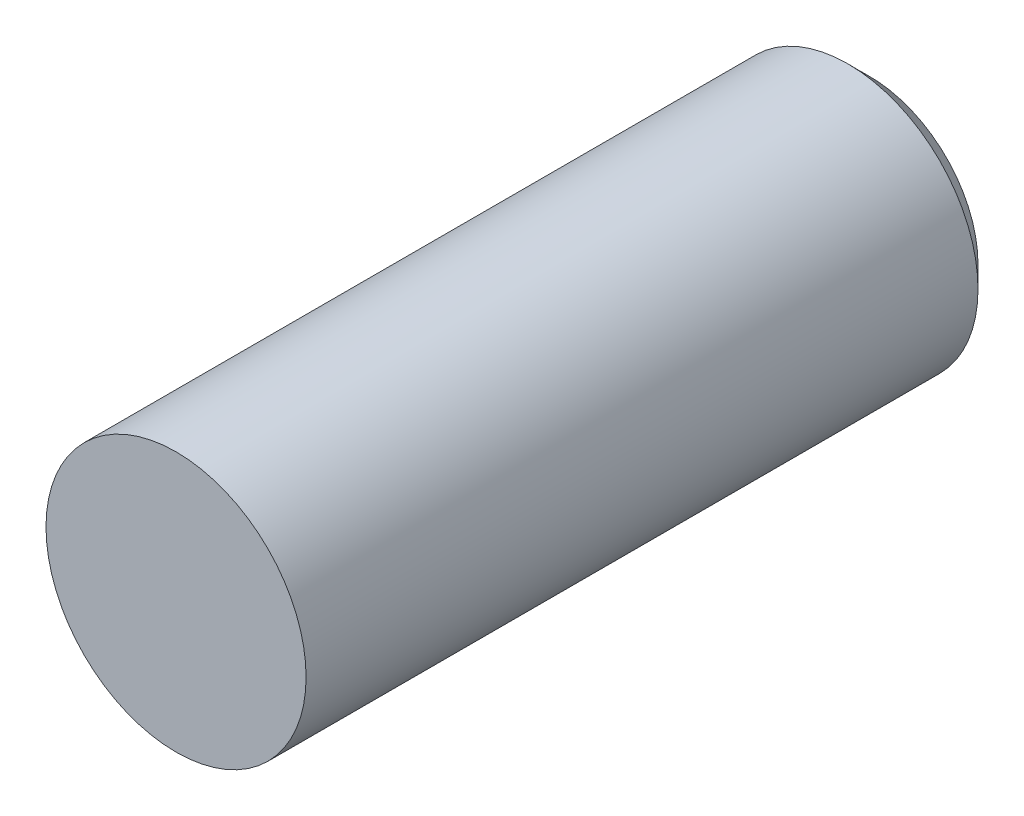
ISO-10303-21;
HEADER;
FILE_DESCRIPTION(('STEP AP214'),'2;1');
FILE_NAME('part.step','',(''),(''),'','','');
FILE_SCHEMA(('AUTOMOTIVE_DESIGN { 1 0 10303 214 1 1 1 1 }'));
ENDSEC;
DATA;
#1=APPLICATION_CONTEXT('core data for automotive mechanical design processes');
#2=APPLICATION_PROTOCOL_DEFINITION('international standard','automotive_design',2000,#1);
#3=PRODUCT_CONTEXT('',#1,'mechanical');
#4=PRODUCT('Part','Part','',(#3));
#5=PRODUCT_RELATED_PRODUCT_CATEGORY('part','',(#4));
#6=PRODUCT_DEFINITION_FORMATION('','',#4);
#7=PRODUCT_DEFINITION_CONTEXT('part definition',#1,'design');
#8=PRODUCT_DEFINITION('design','',#6,#7);
#9=PRODUCT_DEFINITION_SHAPE('','',#8);
#10=(LENGTH_UNIT() NAMED_UNIT(*) SI_UNIT(.MILLI.,.METRE.));
#11=(NAMED_UNIT(*) PLANE_ANGLE_UNIT() SI_UNIT($,.RADIAN.));
#12=(NAMED_UNIT(*) SI_UNIT($,.STERADIAN.) SOLID_ANGLE_UNIT());
#13=UNCERTAINTY_MEASURE_WITH_UNIT(LENGTH_MEASURE(1.E-05),#10,'distance_accuracy_value','');
#14=(GEOMETRIC_REPRESENTATION_CONTEXT(3) GLOBAL_UNCERTAINTY_ASSIGNED_CONTEXT((#13)) GLOBAL_UNIT_ASSIGNED_CONTEXT((#10,
#11,#12)) REPRESENTATION_CONTEXT('',''));
#15=CARTESIAN_POINT('',(0.,0.,0.));
#16=DIRECTION('',(0.,0.,1.));
#17=DIRECTION('',(1.,0.,0.));
#18=AXIS2_PLACEMENT_3D('',#15,#16,#17);
#19=CARTESIAN_POINT('',(0.,0.,8.));
#20=DIRECTION('',(0.,0.,-1.));
#21=DIRECTION('',(-1.,0.,0.));
#22=AXIS2_PLACEMENT_3D('',#19,#20,#21);
#23=CYLINDRICAL_SURFACE('',#22,1.5);
#24=CARTESIAN_POINT('',(0.,0.,0.249999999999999));
#25=DIRECTION('',(0.,0.,1.));
#26=DIRECTION('',(1.,0.,0.));
#27=AXIS2_PLACEMENT_3D('',#24,#25,#26);
#28=CIRCLE('',#27,1.5);
#29=CARTESIAN_POINT('',(1.5,0.,0.249999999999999));
#30=VERTEX_POINT('',#29);
#31=EDGE_CURVE('E47',#30,#30,#28,.T.);
#32=ORIENTED_EDGE('',*,*,#31,.T.);
#33=EDGE_LOOP('',(#32));
#34=FACE_BOUND('',#33,.T.);
#35=CARTESIAN_POINT('',(0.,0.,8.));
#36=DIRECTION('',(0.,0.,1.));
#37=DIRECTION('',(1.,0.,0.));
#38=AXIS2_PLACEMENT_3D('',#35,#36,#37);
#39=CIRCLE('',#38,1.5);
#40=CARTESIAN_POINT('',(1.5,0.,8.));
#41=VERTEX_POINT('',#40);
#42=EDGE_CURVE('E51',#41,#41,#39,.T.);
#43=ORIENTED_EDGE('',*,*,#42,.F.);
#44=EDGE_LOOP('',(#43));
#45=FACE_BOUND('',#44,.T.);
#46=ADVANCED_FACE('F39',(#34,#45),#23,.T.);
#47=CARTESIAN_POINT('',(0.,0.,8.));
#48=DIRECTION('',(0.,0.,1.));
#49=DIRECTION('',(1.,0.,0.));
#50=AXIS2_PLACEMENT_3D('',#47,#48,#49);
#51=PLANE('',#50);
#52=ORIENTED_EDGE('',*,*,#42,.T.);
#53=EDGE_LOOP('',(#52));
#54=FACE_BOUND('',#53,.T.);
#55=ADVANCED_FACE('F58',(#54),#51,.T.);
#56=CARTESIAN_POINT('',(0.,0.,0.));
#57=DIRECTION('',(0.,0.,1.));
#58=DIRECTION('',(1.,0.,0.));
#59=AXIS2_PLACEMENT_3D('',#56,#57,#58);
#60=PLANE('',#59);
#61=CARTESIAN_POINT('',(0.,0.,0.));
#62=DIRECTION('',(0.,0.,1.));
#63=DIRECTION('',(1.,0.,0.));
#64=AXIS2_PLACEMENT_3D('',#61,#62,#63);
#65=CIRCLE('',#64,1.25);
#66=CARTESIAN_POINT('',(1.25,0.,0.));
#67=VERTEX_POINT('',#66);
#68=EDGE_CURVE('E10',#67,#67,#65,.F.);
#69=ORIENTED_EDGE('',*,*,#68,.T.);
#70=EDGE_LOOP('',(#69));
#71=FACE_BOUND('',#70,.T.);
#72=ADVANCED_FACE('F65',(#71),#60,.F.);
#73=CARTESIAN_POINT('',(0.,0.,0.249999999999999));
#74=DIRECTION('',(0.,0.,1.));
#75=DIRECTION('',(1.,0.,0.));
#76=AXIS2_PLACEMENT_3D('',#73,#74,#75);
#77=CONICAL_SURFACE('',#76,1.5,0.785398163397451);
#78=ORIENTED_EDGE('',*,*,#68,.F.);
#79=EDGE_LOOP('',(#78));
#80=FACE_BOUND('',#79,.T.);
#81=ORIENTED_EDGE('',*,*,#31,.F.);
#82=EDGE_LOOP('',(#81));
#83=FACE_BOUND('',#82,.T.);
#84=ADVANCED_FACE('F42',(#80,#83),#77,.T.);
#85=CLOSED_SHELL('',(#46,#55,#72,#84));
#86=MANIFOLD_SOLID_BREP('B2',#85);
#87=ADVANCED_BREP_SHAPE_REPRESENTATION('',(#18,#86),#14);
#88=SHAPE_DEFINITION_REPRESENTATION(#9,#87);
ENDSEC;
END-ISO-10303-21;
